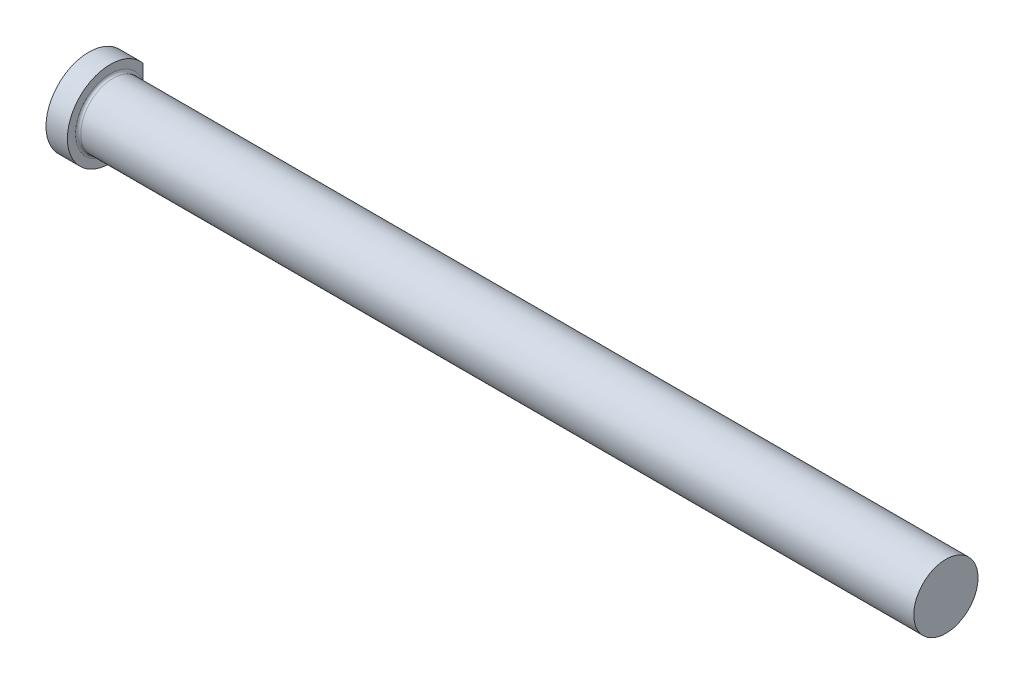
from build123d import *


with BuildPart() as part:
    # Sketch1 → PIN (revolve)
    with BuildSketch(Plane.XY, mode=Mode.PRIVATE) as pin_sk:
        with BuildLine():
            Line((0, 0), (0, 12.7))
            Line((0, 12.7), (6.35, 12.7))
            Line((6.35, 12.7), (6.35, 10.30605))
            ThreePointArc((6.35, 10.30605), (6.58062412, 9.74927412), (7.1374, 9.51865))
            Line((7.1374, 9.51865), (254, 9.51865))
            Line((254, 9.51865), (254, 0))
            Line((254, 0), (0, 0))
        make_face()
    revolve(pin_sk.sketch.rotate(Axis((254, 0, 0), (-1, 0, 0)), 180), axis=Axis((254, 0, 0), (-1, 0, 0)))

    # SurfaceCut1
    split(bisect_by=Plane(origin=(0, 0, -9.69645), x_dir=(-1, 0, 0), z_dir=(0, 0, -1)), keep=Keep.BOTTOM)


solid = part.part
